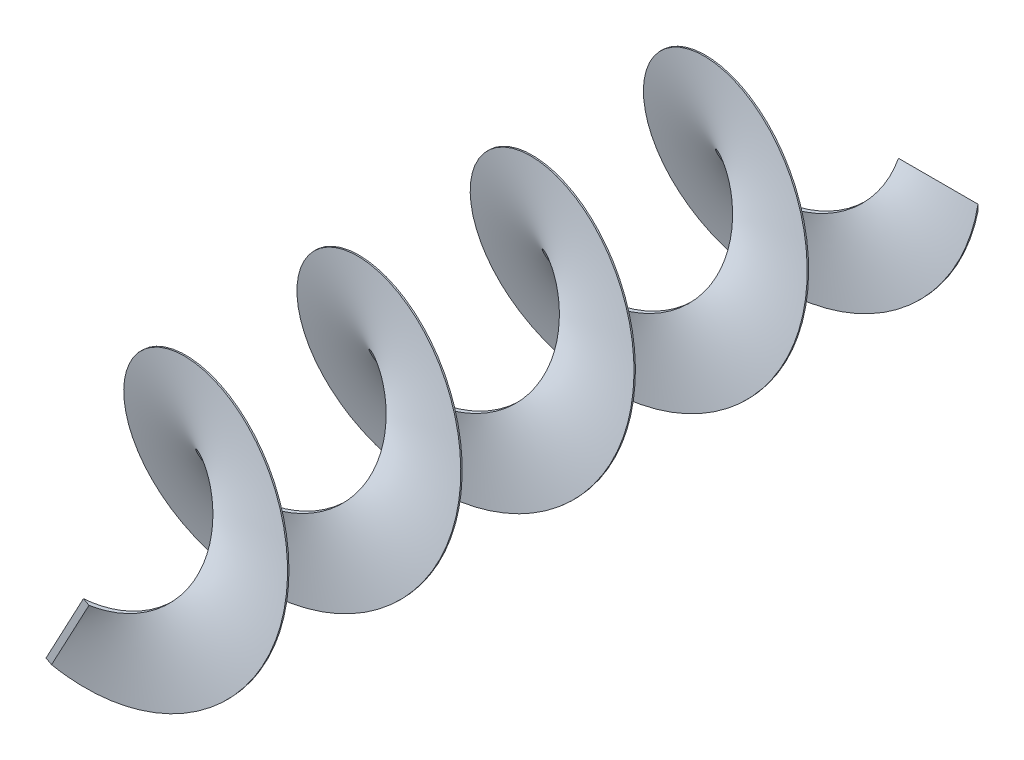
from build123d import *

# Parameters (mm, degrees)
SWEEP1_PITCH  = 220
SWEEP1_HEIGHT = 952.16
SWEEP1_RADIUS = 154.5
SKETCH2_W     = 101
SKETCH2_H     = 8


with BuildPart() as part:
    # Sweep1: sweep along a helix
    with BuildLine() as sweep1_path:
        Helix(SWEEP1_PITCH, SWEEP1_HEIGHT, SWEEP1_RADIUS, center=(0, 0, 0), direction=(0, 0, 1), lefthand=True)
    # Sketch2 → Sweep1 (sweep)
    with BuildSketch(Plane.XY):
        with Locations((104.5, 0)):
            Rectangle(SKETCH2_W, SKETCH2_H)
    sweep(path=sweep1_path.line, is_frenet=True)


solid = part.part
